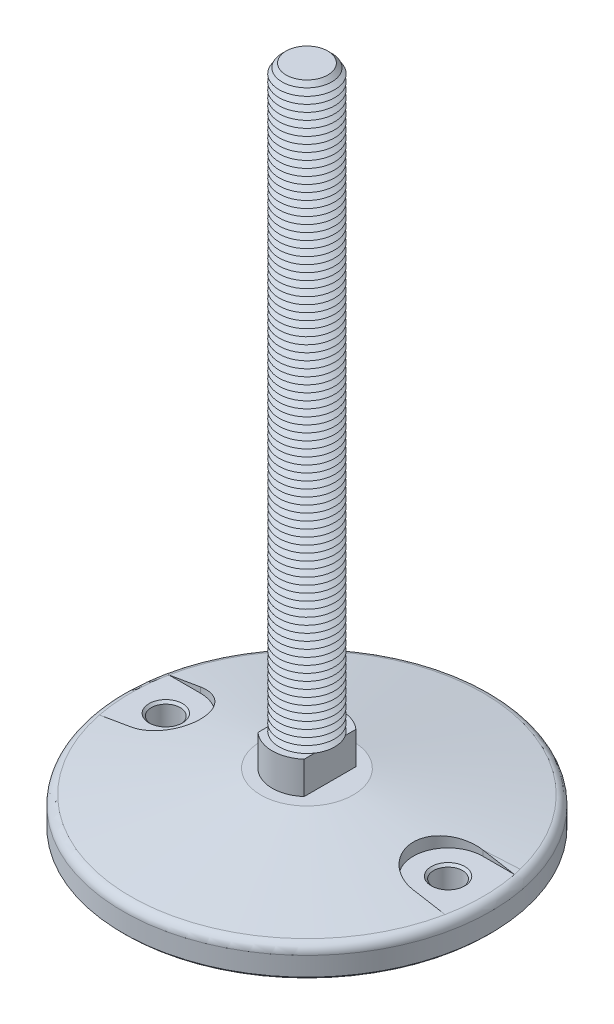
from build123d import *

# Parameters (mm, degrees)
FILLET1_R                = 4
SKETCH3_R                = 15
BOSS_EXTRUDE1_DEPTH      = 14
CUT_EXTRUDE1_START       = -14
CUT_EXTRUDE1_DEPTH       = 14
SKETCH5_R                = 12
BOSS_EXTRUDE2_DEPTH      = 250
CHAMFER1_SIZE            = 3
LPATTERN1_COUNT          = 83
LPATTERN1_PITCH          = 3
CUT_EXTRUDE4_DEPTH       = 9.91
SKETCH10_R               = 6.25
CUT_EXTRUDE5_DEPTH       = 13.09
CHAMFER2_SIZE            = 1
CHAMFER2_OF_MIRROR1_SIZE = 1
CHAMFER3_SIZE            = 1


with BuildPart() as part:
    # Sketch2 → Revolve1 (revolve)
    with BuildSketch(Plane(origin=(0, 0, 0), x_dir=(0, 0, -1), z_dir=(1, 0, 0)), mode=Mode.PRIVATE) as revolve1_sk:
        Polygon((0, 0), (-20, 0), (-79.5, -10.491455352), (-79.5, -23), (0, -23), align=None)
    revolve(revolve1_sk.sketch.rotate(Axis((0, 61.338865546, 0), (0, -1, 0)), 180), axis=Axis((0, 61.338865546, 0), (0, -1, 0)))

    # Fillet1
    fillet1_edges = [part.edges().sort_by_distance(p)[0] for p in [
        (0, -10.491455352, 79.5),
    ]]
    fillet(fillet1_edges, radius=FILLET1_R)

    # Sketch3 → Boss-Extrude1 (add)
    with BuildSketch(Plane(origin=(0, 0, 0), x_dir=(1, 0, 0), z_dir=(0, 1, 0))):
        with Locations(Location((0, 0, 0), (0, 0, 270))):
            Circle(SKETCH3_R)
    extrude(amount=BOSS_EXTRUDE1_DEPTH)

    # Sketch4 → Cut-Extrude1 (cut)
    with BuildSketch(Plane(origin=(0, 14, 0), x_dir=(1, 0, 0), z_dir=(0, 1, 0)).offset(CUT_EXTRUDE1_START)):
        with BuildLine():
            Line((-10, 11.180339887), (-10, -11.180339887))
            ThreePointArc((-10, -11.180339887), (-15, 0), (-10, 11.180339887))
        make_face()
        with BuildLine():
            Line((10, -11.180339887), (10, 11.180339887))
            ThreePointArc((10, 11.180339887), (15, 0), (10, -11.180339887))
        make_face()
    extrude(amount=CUT_EXTRUDE1_DEPTH, mode=Mode.SUBTRACT)

    # Sketch5 → Boss-Extrude2 (add)
    with BuildSketch(Plane(origin=(0, 14, 0), x_dir=(1, 0, 0), z_dir=(0, 1, 0))):
        with Locations(Location((0, 0, 0), (0, 0, 33.557309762))):
            Circle(SKETCH5_R)
    extrude(amount=BOSS_EXTRUDE2_DEPTH)

    # Chamfer1
    chamfer1_edges = [part.edges().sort_by_distance(p)[0] for p in [
        (-10, 264, 6.633249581),
    ]]
    chamfer(chamfer1_edges, length=CHAMFER1_SIZE)

    # Sketch6 → Cut-Revolve1 (revolve, cut)
    with BuildSketch(Plane(origin=(0, 0, 0), x_dir=(0, 0, -1), z_dir=(1, 0, 0))):
        Polygon((-12, 14), (-9.401923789, 15.5), (-12, 17), align=None)
    cut_revolve1 = revolve(axis=Axis((0, 61.338865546, 0), (0, -1, 0)), mode=Mode.SUBTRACT)

    # LPattern1: Cut-Revolve1 ×83
    with Locations(*[(0, i * LPATTERN1_PITCH, 0) for i in range(1, LPATTERN1_COUNT)]):
        add(cut_revolve1, mode=Mode.SUBTRACT)

    # Sketch8 → Cut-Extrude4 (cut)
    with BuildSketch(Plane(origin=(0, 0, 0), x_dir=(1, 0, 0), z_dir=(0, 1, 0))):
        with BuildLine():
            Line((-61, 15), (-74.703520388, 15))
            ThreePointArc((-74.703520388, 15), (-76.194592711, 0), (-74.703520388, -15))
            Line((-74.703520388, -15), (-61, -15))
            ThreePointArc((-61, -15), (-46, 0), (-61, 15))
        make_face()
    cut_extrude4 = extrude(amount=-CUT_EXTRUDE4_DEPTH, mode=Mode.SUBTRACT)

    # Sketch10 → Cut-Extrude5 (cut)
    with BuildSketch(Plane(origin=(0, -9.91, 0), x_dir=(1, 0, 0), z_dir=(0, 1, 0))):
        with Locations(Location((-61, 0, 0), (0, 0, 270))):
            Circle(SKETCH10_R)
    cut_extrude5 = extrude(amount=-CUT_EXTRUDE5_DEPTH, mode=Mode.SUBTRACT)

    # Chamfer2
    chamfer2_edges = [part.edges().sort_by_distance(p)[0] for p in [
        (-61, -9.91, -6.25),
        (-61, -23, -6.25),
    ]]
    chamfer(chamfer2_edges, length=CHAMFER2_SIZE)

    # Mirror1: Cut-Extrude4, Cut-Extrude5 across plane
    add(cut_extrude4.mirror(Plane(origin=(0, 0, 0), x_dir=(0, 0, 1), z_dir=(1, 0, 0))), mode=Mode.SUBTRACT)
    add(cut_extrude5.mirror(Plane(origin=(0, 0, 0), x_dir=(0, 0, 1), z_dir=(1, 0, 0))), mode=Mode.SUBTRACT)

    # Chamfer2 of Mirror1
    chamfer2_of_mirror1_edges = [part.edges().sort_by_distance(p)[0] for p in [
        (61, -9.91, -6.25),
        (61, -23, -6.25),
    ]]
    chamfer(chamfer2_of_mirror1_edges, length=CHAMFER2_OF_MIRROR1_SIZE)

    # Chamfer3
    chamfer3_edges = [part.edges().sort_by_distance(p)[0] for p in [
        (0, -23, 79.5),
    ]]
    chamfer(chamfer3_edges, length=CHAMFER3_SIZE)


solid = part.part
